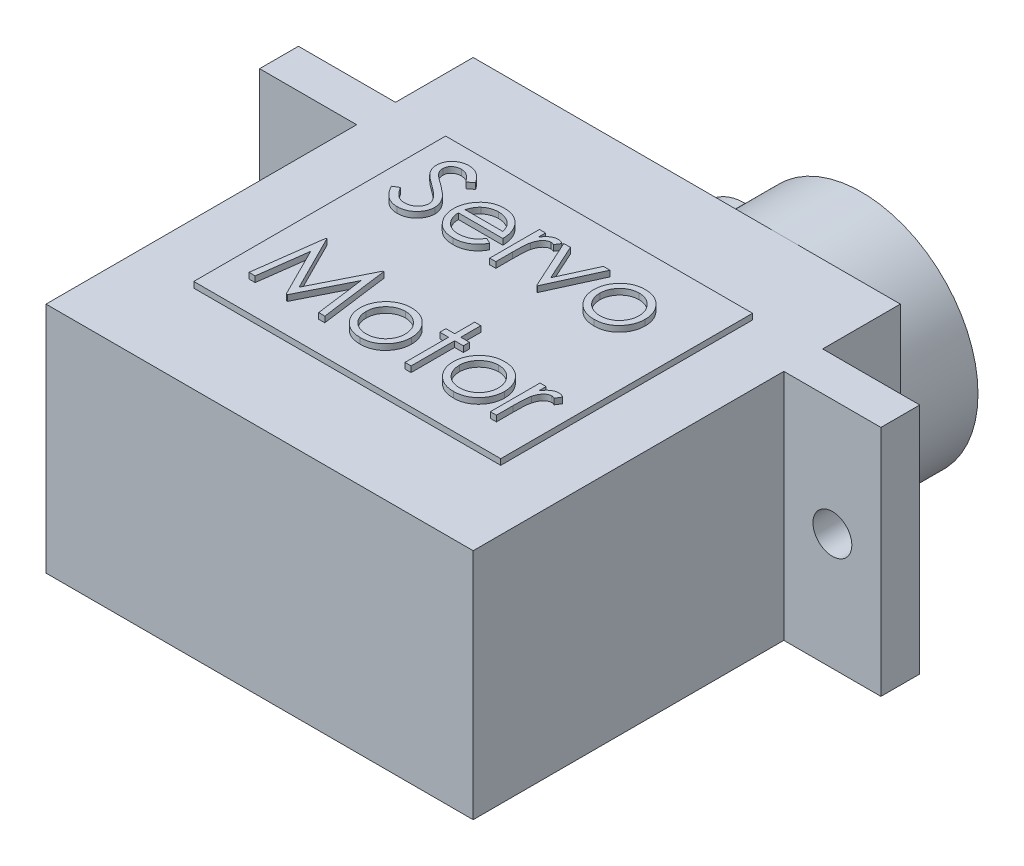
from build123d import *

# Parameters (mm, degrees)
BOSS_EXTRUDE1_DEPTH = 12
BOSS_EXTRUDE2_DEPTH = 4
SKETCH3_W           = 15.808123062
SKETCH3_H           = 12.968405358
BOSS_EXTRUDE3_DEPTH = 0.3
BOSS_EXTRUDE4_DEPTH = 0.3
SKETCH5_R           = 2.5
BOSS_EXTRUDE5_DEPTH = 2
CUT_EXTRUDE2_REACH  = 29.18
SKETCH8_R           = 1


with BuildPart() as part:
    # Sketch1 → Boss-Extrude1 (new body)
    with BuildSketch(Plane(origin=(0, 0, 0), x_dir=(1, 0, 0), z_dir=(0, 1, 0))):
        Polygon((-11, 5), (-11, -11), (11, -11), (11, 5), (16, 5), (16, 7), (11, 7), (11, 11), (-11, 11), (-11, 7), (-16, 7), (-16, 5), align=None)
    extrude(amount=BOSS_EXTRUDE1_DEPTH)

    # Sketch2 → Boss-Extrude2 (add)
    with BuildSketch(Plane(origin=(0, 0, -11), x_dir=(-1, 0, 0), z_dir=(0, 0, -1))):
        with BuildLine():
            Line((1, 8.5), (0.454356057, 8.5))
            ThreePointArc((0.454356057, 8.5), (-11, 6), (0.454356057, 3.5))
            Line((0.454356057, 3.5), (1, 3.5))
            ThreePointArc((1, 3.5), (3.5, 6), (1, 8.5))
        make_face()
    extrude(amount=BOSS_EXTRUDE2_DEPTH)

    # Sketch3 → Boss-Extrude3 (add)
    with BuildSketch(Plane(origin=(0, 12, 0), x_dir=(1, 0, 0), z_dir=(0, 1, 0))):
        Rectangle(SKETCH3_W, SKETCH3_H)
    extrude(amount=BOSS_EXTRUDE3_DEPTH)

    # Sketch4 → Boss-Extrude4 (add)
    # profile 1 of 10: a face of its own
    with BuildSketch(Plane(origin=(0, 12.3, 0), x_dir=(1, 0, 0), z_dir=(0, 1, 0))):
        with BuildLine():
            Line((-6.767422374, 2.553042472), (-6.471548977, 2.730426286))
            add(Edge.make_bspline(
                [(-6.471548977, 2.730426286), (-6.444030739, 2.684361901), (-6.391306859, 2.596104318), (-6.3033555, 2.476846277), (-6.212222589, 2.37548412), (-6.117233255, 2.292607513), (-6.018967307, 2.227358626), (-5.916783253, 2.181156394), (-5.811025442, 2.152340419), (-5.739051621, 2.148840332), (-5.70311949, 2.147092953)],
                knots=[0, 0, 0, 0, 1.272034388, 2.437168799, 3.508375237, 4.49857839, 5.41946034, 6.295179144, 7.148887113, 8, 8, 8, 8], degree=3))
            add(Edge.make_bspline(
                [(-5.70311949, 2.147092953), (-5.672432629, 2.147947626), (-5.611595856, 2.149642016), (-5.522033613, 2.165922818), (-5.435051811, 2.190934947), (-5.352443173, 2.226755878), (-5.275347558, 2.270094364), (-5.207740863, 2.322440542), (-5.14929475, 2.381046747), (-5.101485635, 2.446429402), (-5.0648056, 2.516746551), (-5.036613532, 2.588922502), (-5.020968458, 2.66409107), (-5.018611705, 2.714701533), (-5.017422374, 2.740241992)],
                knots=[0, 0, 0, 0, 1.095163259, 2.171163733, 3.241058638, 4.321873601, 5.38011039, 6.391990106, 7.366004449, 8.327778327, 9.272591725, 10.192022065, 11.087607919, 12, 12, 12, 12], degree=3))
            add(Edge.make_bspline(
                [(-5.017422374, 2.740241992), (-5.018896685, 2.769382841), (-5.021893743, 2.82862193), (-5.047225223, 2.916021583), (-5.08707447, 3.002514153), (-5.123837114, 3.056015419), (-5.142923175, 3.083791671)],
                knots=[0, 0, 0, 0, 0.938893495, 1.908633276, 2.914225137, 4, 4, 4, 4], degree=3))
            add(Edge.make_bspline(
                [(-5.142923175, 3.083791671), (-5.15859379, 3.103838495), (-5.191492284, 3.145924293), (-5.248049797, 3.208569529), (-5.314415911, 3.273187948), (-5.388319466, 3.342247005), (-5.472452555, 3.412534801), (-5.564180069, 3.487403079), (-5.665843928, 3.564004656), (-5.737143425, 3.615377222), (-5.773932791, 3.64188462)],
                knots=[0, 0, 0, 0, 0.722233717, 1.516239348, 2.393582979, 3.351407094, 4.387010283, 5.505090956, 6.712668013, 8, 8, 8, 8], degree=3))
            add(Edge.make_bspline(
                [(-5.773932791, 3.64188462), (-5.810756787, 3.668113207), (-5.881161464, 3.71826027), (-5.979620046, 3.792684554), (-6.067664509, 3.860728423), (-6.144903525, 3.923032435), (-6.211303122, 3.97960504), (-6.267386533, 4.029902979), (-6.31172509, 4.07528654), (-6.336380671, 4.104727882), (-6.347450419, 4.117946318)],
                knots=[0, 0, 0, 0, 1.452282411, 2.77665338, 3.964542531, 5.026858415, 5.96415736, 6.766646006, 7.446254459, 8, 8, 8, 8], degree=3))
            add(Edge.make_bspline(
                [(-6.347450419, 4.117946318), (-6.362922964, 4.138547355), (-6.393351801, 4.179062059), (-6.433517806, 4.242386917), (-6.467656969, 4.307210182), (-6.494419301, 4.373706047), (-6.51695552, 4.440940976), (-6.532113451, 4.509792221), (-6.541604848, 4.57995084), (-6.542576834, 4.62716434), (-6.5430634, 4.650798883)],
                knots=[0, 0, 0, 0, 1.068054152, 2.10047183, 3.106115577, 4.101338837, 5.06977816, 6.043150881, 7.020423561, 8, 8, 8, 8], degree=3))
            add(Edge.make_bspline(
                [(-6.5430634, 4.650798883), (-6.541758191, 4.687828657), (-6.539175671, 4.761096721), (-6.517335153, 4.868127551), (-6.48286226, 4.970313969), (-6.434567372, 5.066644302), (-6.372310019, 5.154610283), (-6.300264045, 5.23522377), (-6.214452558, 5.302992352), (-6.120299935, 5.362204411), (-6.017243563, 5.408550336), (-5.90925266, 5.443511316), (-5.796155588, 5.463320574), (-5.719552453, 5.466163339), (-5.680683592, 5.467605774)],
                knots=[0, 0, 0, 0, 1.005424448, 1.989358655, 2.955360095, 3.929531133, 4.905563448, 5.876582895, 6.856512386, 7.866279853, 8.892233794, 9.918561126, 10.94386622, 12, 12, 12, 12], degree=3))
            add(Edge.make_bspline(
                [(-5.680683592, 5.467605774), (-5.639439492, 5.466183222), (-5.55741814, 5.463354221), (-5.436768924, 5.43875669), (-5.320608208, 5.398056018), (-5.227164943, 5.35186736), (-5.154032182, 5.305735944), (-5.098259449, 5.26371612), (-5.041741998, 5.215341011), (-4.984023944, 5.160481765), (-4.926083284, 5.098635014), (-4.867059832, 5.030224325), (-4.806815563, 4.955667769), (-4.768059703, 4.902443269), (-4.748191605, 4.875157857)],
                knots=[0, 0, 0, 0, 1.286793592, 2.559021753, 3.825965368, 5.121522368, 5.803751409, 6.523245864, 7.299691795, 8.125521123, 9.008227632, 9.944561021, 10.946284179, 12, 12, 12, 12], degree=3))
            Line((-4.748191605, 4.875157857), (-5.032145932, 4.659913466))
            add(Edge.make_bspline(
                [(-5.032145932, 4.659913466), (-5.049291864, 4.682002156), (-5.082310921, 4.72453981), (-5.132440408, 4.784111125), (-5.179689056, 4.838527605), (-5.226239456, 4.885792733), (-5.269633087, 4.928494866), (-5.31175013, 4.965054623), (-5.351984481, 4.995830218), (-5.402701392, 5.028673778), (-5.46641911, 5.061230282), (-5.546403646, 5.08877936), (-5.629989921, 5.105334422), (-5.686919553, 5.107523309), (-5.715739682, 5.108631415)],
                knots=[0, 0, 0, 0, 1.181633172, 2.275549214, 3.290209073, 4.226197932, 5.078386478, 5.862611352, 6.581680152, 7.217281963, 8.414376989, 9.595101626, 10.782541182, 12, 12, 12, 12], degree=3))
            add(Edge.make_bspline(
                [(-5.715739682, 5.108631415), (-5.751896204, 5.107419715), (-5.821620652, 5.105083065), (-5.920610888, 5.07956308), (-6.009704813, 5.03938122), (-6.086257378, 4.983066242), (-6.149994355, 4.916345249), (-6.196099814, 4.839566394), (-6.223849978, 4.754783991), (-6.227236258, 4.695642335), (-6.228960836, 4.66552244)],
                knots=[0, 0, 0, 0, 1.14458467, 2.207223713, 3.21896685, 4.227309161, 5.202851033, 6.127160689, 7.046193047, 8, 8, 8, 8], degree=3))
            add(Edge.make_bspline(
                [(-6.228960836, 4.66552244), (-6.228567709, 4.646770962), (-6.227780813, 4.609237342), (-6.216806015, 4.55378592), (-6.202706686, 4.498474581), (-6.180364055, 4.443551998), (-6.149518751, 4.388057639), (-6.109013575, 4.331035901), (-6.058000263, 4.271984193), (-6.018923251, 4.233576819), (-5.998291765, 4.213298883)],
                knots=[0, 0, 0, 0, 0.858281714, 1.717966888, 2.583508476, 3.4729293, 4.427298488, 5.488583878, 6.674047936, 8, 8, 8, 8], degree=3))
            add(Edge.make_bspline(
                [(-5.998291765, 4.213298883), (-5.990630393, 4.206461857), (-5.972428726, 4.190218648), (-5.9391528, 4.163626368), (-5.895210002, 4.130823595), (-5.8417478, 4.090236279), (-5.777780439, 4.043154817), (-5.703300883, 3.990181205), (-5.61913935, 3.929595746), (-5.559417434, 3.887238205), (-5.527839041, 3.864841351)],
                knots=[0, 0, 0, 0, 0.420754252, 0.999615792, 1.744751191, 2.668019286, 3.750313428, 4.999500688, 6.413464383, 8, 8, 8, 8], degree=3))
            add(Edge.make_bspline(
                [(-5.527839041, 3.864841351), (-5.489853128, 3.837199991), (-5.416298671, 3.783676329), (-5.311641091, 3.703260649), (-5.216747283, 3.624612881), (-5.13128408, 3.548235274), (-5.054407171, 3.474707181), (-4.98696945, 3.403144), (-4.92828377, 3.334058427), (-4.865104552, 3.245485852), (-4.800546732, 3.136704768), (-4.745105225, 3.003426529), (-4.710146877, 2.869630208), (-4.705575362, 2.779703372), (-4.70331981, 2.735334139)],
                knots=[0, 0, 0, 0, 1.163667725, 2.253281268, 3.268753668, 4.215851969, 5.092017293, 5.902905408, 6.650798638, 7.335211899, 8.59617414, 9.77448103, 10.901945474, 12, 12, 12, 12], degree=3))
            add(Edge.make_bspline(
                [(-4.70331981, 2.735334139), (-4.703976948, 2.703955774), (-4.705278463, 2.64180839), (-4.720239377, 2.550553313), (-4.742159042, 2.461922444), (-4.775196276, 2.377011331), (-4.815519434, 2.294266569), (-4.866685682, 2.215858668), (-4.925993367, 2.14005227), (-4.994027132, 2.068868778), (-5.068473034, 2.003522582), (-5.147156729, 1.945393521), (-5.230207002, 1.896925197), (-5.317173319, 1.857374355), (-5.408075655, 1.826440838), (-5.502883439, 1.804027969), (-5.60175295, 1.790272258), (-5.668953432, 1.788844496), (-5.70311949, 1.788118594)],
                knots=[0, 0, 0, 0, 0.983748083, 1.948392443, 2.894712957, 3.844097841, 4.80183111, 5.778335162, 6.776009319, 7.81870978, 8.863265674, 9.881300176, 10.883814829, 11.87499822, 12.874611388, 13.892143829, 14.928324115, 16, 16, 16, 16], degree=3))
            add(Edge.make_bspline(
                [(-5.70311949, 1.788118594), (-5.729554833, 1.788629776), (-5.782092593, 1.789645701), (-5.859802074, 1.798626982), (-5.935941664, 1.811334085), (-6.009555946, 1.831508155), (-6.081593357, 1.855985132), (-6.151740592, 1.886123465), (-6.220031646, 1.922240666), (-6.286849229, 1.963535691), (-6.352023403, 2.011593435), (-6.414942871, 2.067566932), (-6.477672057, 2.129912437), (-6.538359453, 2.200323), (-6.598232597, 2.277661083), (-6.656111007, 2.362650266), (-6.713192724, 2.45482762), (-6.749008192, 2.519692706), (-6.767422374, 2.553042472)],
                knots=[0, 0, 0, 0, 0.915332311, 1.819136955, 2.706846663, 3.586547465, 4.459518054, 5.340707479, 6.227863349, 7.133153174, 8.059268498, 9.028702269, 10.047606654, 11.120612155, 12.245963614, 13.433783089, 14.680604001, 16, 16, 16, 16], degree=3))
        make_face()
    # profile 2 of 10: a face of its own
    with BuildSketch(Plane(origin=(0, 12.3, 0), x_dir=(1, 0, 0), z_dir=(0, 1, 0))):
        with BuildLine():
            Line((-1.975956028, 2.685554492), (-1.696909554, 2.539020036))
            add(Edge.make_bspline(
                [(-1.696909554, 2.539020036), (-1.719146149, 2.499576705), (-1.762409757, 2.422835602), (-1.836810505, 2.317403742), (-1.914802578, 2.222556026), (-1.999906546, 2.140826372), (-2.089576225, 2.069574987), (-2.18430888, 2.007237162), (-2.284597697, 1.954118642), (-2.390447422, 1.909366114), (-2.502746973, 1.87495662), (-2.62176849, 1.850652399), (-2.747739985, 1.83562913), (-2.834086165, 1.833883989), (-2.878299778, 1.832990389)],
                knots=[0, 0, 0, 0, 1.120438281, 2.179929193, 3.190490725, 4.156257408, 5.095198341, 6.022838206, 6.959905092, 7.901321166, 8.864066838, 9.862729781, 10.905609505, 12, 12, 12, 12], degree=3))
            add(Edge.make_bspline(
                [(-2.878299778, 1.832990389), (-2.927441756, 1.834137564), (-3.023303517, 1.836375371), (-3.162843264, 1.855667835), (-3.294222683, 1.887140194), (-3.417434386, 1.931105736), (-3.532176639, 1.98853306), (-3.638677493, 2.058492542), (-3.737497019, 2.140624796), (-3.825521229, 2.23564124), (-3.904765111, 2.337323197), (-3.974690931, 2.443279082), (-4.033148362, 2.553242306), (-4.080700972, 2.66651283), (-4.119105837, 2.782376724), (-4.145872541, 2.901888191), (-4.161302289, 3.024723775), (-4.163666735, 3.107821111), (-4.164858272, 3.14969712)],
                knots=[0, 0, 0, 0, 1.145258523, 2.234067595, 3.276747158, 4.290159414, 5.277019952, 6.260822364, 7.254936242, 8.264827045, 9.274100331, 10.257902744, 11.220704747, 12.172965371, 13.118907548, 14.062713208, 15.023725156, 16, 16, 16, 16], degree=3))
            add(Edge.make_bspline(
                [(-4.164858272, 3.14969712), (-4.16379913, 3.18899195), (-4.161700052, 3.266869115), (-4.148469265, 3.382134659), (-4.125020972, 3.494163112), (-4.092844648, 3.60304756), (-4.051293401, 3.708605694), (-4.000461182, 3.810901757), (-3.940268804, 3.909826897), (-3.893796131, 3.972230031), (-3.870387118, 4.003663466)],
                knots=[0, 0, 0, 0, 1.024358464, 2.0301432, 3.019427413, 4.004406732, 4.986367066, 5.972626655, 6.978780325, 8, 8, 8, 8], degree=3))
            add(Edge.make_bspline(
                [(-3.870387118, 4.003663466), (-3.838679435, 4.041532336), (-3.776268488, 4.116070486), (-3.670712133, 4.214008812), (-3.556411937, 4.296052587), (-3.434800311, 4.364059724), (-3.304463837, 4.415733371), (-3.167154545, 4.454240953), (-3.021308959, 4.475818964), (-2.921603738, 4.478866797), (-2.870587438, 4.480426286)],
                knots=[0, 0, 0, 0, 1.030682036, 2.02871468, 2.997146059, 3.962720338, 4.930598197, 5.918074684, 6.934738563, 8, 8, 8, 8], degree=3))
            add(Edge.make_bspline(
                [(-2.870587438, 4.480426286), (-2.818139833, 4.479072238), (-2.715249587, 4.476415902), (-2.565217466, 4.451789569), (-2.423256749, 4.412737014), (-2.289424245, 4.357583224), (-2.163706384, 4.286423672), (-2.046920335, 4.198281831), (-1.937068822, 4.095863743), (-1.873160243, 4.017100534), (-1.840639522, 3.977020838)],
                knots=[0, 0, 0, 0, 1.056321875, 2.072262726, 3.055038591, 4.01806755, 4.982017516, 5.957941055, 6.960871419, 8, 8, 8, 8], degree=3))
            add(Edge.make_bspline(
                [(-1.840639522, 3.977020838), (-1.818512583, 3.946817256), (-1.77440599, 3.886611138), (-1.71915889, 3.788439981), (-1.671201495, 3.685729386), (-1.632868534, 3.576819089), (-1.601829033, 3.462999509), (-1.579372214, 3.343456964), (-1.566202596, 3.218227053), (-1.563613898, 3.132900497), (-1.562294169, 3.089400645)],
                knots=[0, 0, 0, 0, 0.94817472, 1.890038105, 2.849395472, 3.817997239, 4.812318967, 5.836947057, 6.897266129, 8, 8, 8, 8], degree=3))
            Line((-1.562294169, 3.089400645), (-3.850755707, 3.089400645))
            add(Edge.make_bspline(
                [(-3.850755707, 3.089400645), (-3.849216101, 3.055700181), (-3.846188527, 2.989429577), (-3.832073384, 2.892458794), (-3.80982461, 2.800085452), (-3.778555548, 2.71300241), (-3.740688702, 2.630072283), (-3.694302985, 2.551910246), (-3.638963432, 2.478872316), (-3.577237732, 2.410305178), (-3.508530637, 2.349244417), (-3.43624789, 2.294592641), (-3.359354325, 2.248787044), (-3.278456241, 2.211607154), (-3.193684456, 2.182500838), (-3.105012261, 2.162633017), (-3.012614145, 2.149325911), (-2.94962841, 2.147846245), (-2.917562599, 2.147092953)],
                knots=[0, 0, 0, 0, 1.094153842, 2.151609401, 3.174256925, 4.172055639, 5.149267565, 6.128595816, 7.11444997, 8.118368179, 9.117203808, 10.09244225, 11.054858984, 12.015122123, 12.976791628, 13.957293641, 14.960065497, 16, 16, 16, 16], degree=3))
            add(Edge.make_bspline(
                [(-2.917562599, 2.147092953), (-2.886211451, 2.14770101), (-2.82400476, 2.148907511), (-2.731363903, 2.160639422), (-2.640224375, 2.179609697), (-2.550963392, 2.205499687), (-2.465392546, 2.23707654), (-2.386146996, 2.275179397), (-2.31326678, 2.317329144), (-2.245149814, 2.365538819), (-2.17907882, 2.424547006), (-2.113536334, 2.498182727), (-2.043259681, 2.585270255), (-1.999270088, 2.650815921), (-1.975956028, 2.685554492)],
                knots=[0, 0, 0, 0, 0.99110716, 1.966546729, 2.947904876, 3.932708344, 4.903319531, 5.828989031, 6.710028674, 7.56322171, 8.463672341, 9.504779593, 10.677557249, 12, 12, 12, 12], degree=3))
        make_face()
        with BuildLine():
            add(Edge.make_bspline(
                [(-1.876396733, 3.403503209), (-1.887893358, 3.445166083), (-1.910020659, 3.525353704), (-1.956257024, 3.636394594), (-2.008328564, 3.735082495), (-2.069950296, 3.820662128), (-2.139769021, 3.896665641), (-2.220414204, 3.963084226), (-2.310850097, 4.022501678), (-2.410609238, 4.072654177), (-2.516251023, 4.115344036), (-2.626857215, 4.143969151), (-2.739715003, 4.163578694), (-2.816049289, 4.165404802), (-2.854461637, 4.166323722)],
                knots=[0, 0, 0, 0, 1.154881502, 2.222775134, 3.210006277, 4.132804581, 5.035138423, 5.962687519, 6.919655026, 7.923214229, 8.944639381, 9.960483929, 10.97369054, 12, 12, 12, 12], degree=3))
            add(Edge.make_bspline(
                [(-2.854461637, 4.166323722), (-2.885811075, 4.165712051), (-2.947782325, 4.164502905), (-3.039083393, 4.153032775), (-3.126763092, 4.134072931), (-3.211468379, 4.108107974), (-3.292089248, 4.073499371), (-3.370284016, 4.032916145), (-3.444064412, 3.983374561), (-3.490205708, 3.945615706), (-3.513516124, 3.926540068)],
                knots=[0, 0, 0, 0, 1.04873581, 2.073130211, 3.073294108, 4.04793562, 5.032784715, 6.005352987, 6.992311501, 8, 8, 8, 8], degree=3))
            add(Edge.make_bspline(
                [(-3.513516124, 3.926540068), (-3.530209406, 3.911445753), (-3.56399254, 3.880898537), (-3.609133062, 3.82826933), (-3.652353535, 3.771517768), (-3.691687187, 3.708472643), (-3.727764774, 3.639851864), (-3.761524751, 3.566234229), (-3.791911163, 3.487061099), (-3.809007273, 3.43188866), (-3.817802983, 3.403503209)],
                knots=[0, 0, 0, 0, 0.879870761, 1.780643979, 2.707998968, 3.669668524, 4.684282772, 5.740141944, 6.837334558, 8, 8, 8, 8], degree=3))
            Line((-3.817802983, 3.403503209), (-1.876396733, 3.403503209))
        make_face(mode=Mode.SUBTRACT)
    # profile 3 of 10: a face of its own
    with BuildSketch(Plane(origin=(0, 12.3, 0), x_dir=(1, 0, 0), z_dir=(0, 1, 0))):
        with BuildLine():
            Line((-1.023832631, 4.435554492), (-0.709730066, 4.435554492))
            Line((-0.709730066, 4.435554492), (-0.709730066, 4.059052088))
            add(Edge.make_bspline(
                [(-0.709730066, 4.059052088), (-0.686541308, 4.094107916), (-0.642192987, 4.161151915), (-0.568480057, 4.249821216), (-0.492976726, 4.323236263), (-0.415321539, 4.381739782), (-0.334943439, 4.425552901), (-0.253606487, 4.457645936), (-0.170031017, 4.476623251), (-0.113869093, 4.47915691), (-0.085731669, 4.480426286)],
                knots=[0, 0, 0, 0, 1.2804753, 2.448899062, 3.506932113, 4.484331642, 5.4025378, 6.288909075, 7.142734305, 8, 8, 8, 8], degree=3))
            add(Edge.make_bspline(
                [(-0.085731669, 4.480426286), (-0.063905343, 4.47923576), (-0.018996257, 4.476786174), (0.048986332, 4.459575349), (0.119029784, 4.432097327), (0.164172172, 4.406257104), (0.187705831, 4.392786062)],
                knots=[0, 0, 0, 0, 0.901110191, 1.854092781, 2.881294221, 4, 4, 4, 4], degree=3))
            Line((0.187705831, 4.392786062), (0.015229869, 4.120750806))
            add(Edge.make_bspline(
                [(0.015229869, 4.120750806), (0.000120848, 4.127491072), (-0.028558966, 4.140285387), (-0.070513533, 4.155427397), (-0.109194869, 4.164343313), (-0.133838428, 4.165694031), (-0.145327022, 4.166323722)],
                knots=[0, 0, 0, 0, 1.180555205, 2.24091978, 3.179933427, 4, 4, 4, 4], degree=3))
            add(Edge.make_bspline(
                [(-0.145327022, 4.166323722), (-0.170532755, 4.164643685), (-0.221945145, 4.161216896), (-0.297429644, 4.134278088), (-0.37067685, 4.090752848), (-0.428848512, 4.042481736), (-0.473890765, 3.995933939), (-0.506030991, 3.955285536), (-0.535513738, 3.909706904), (-0.563683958, 3.859977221), (-0.589350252, 3.805247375), (-0.613304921, 3.746064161), (-0.634963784, 3.682359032), (-0.647314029, 3.637976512), (-0.653640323, 3.615241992)],
                knots=[0, 0, 0, 0, 1.125678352, 2.296057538, 3.5422874, 4.923748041, 5.663163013, 6.437101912, 7.23742474, 8.08941207, 8.991984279, 9.93940061, 10.944477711, 12, 12, 12, 12], degree=3))
            add(Edge.make_bspline(
                [(-0.653640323, 3.615241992), (-0.658372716, 3.594964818), (-0.668854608, 3.550052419), (-0.679046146, 3.474703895), (-0.689115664, 3.385680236), (-0.696212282, 3.282733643), (-0.702790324, 3.166121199), (-0.706500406, 3.035665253), (-0.709603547, 2.891231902), (-0.709686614, 2.790257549), (-0.709730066, 2.737437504)],
                knots=[0, 0, 0, 0, 0.566838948, 1.255505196, 2.06880316, 3.007127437, 4.065329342, 5.249902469, 6.561414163, 8, 8, 8, 8], degree=3))
            Line((-0.709730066, 2.737437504), (-0.709730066, 1.877862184))
            Line((-0.709730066, 1.877862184), (-1.023832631, 1.877862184))
            Line((-1.023832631, 1.877862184), (-1.023832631, 4.435554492))
        make_face()
    # profile 4 of 10: a face of its own
    with BuildSketch(Plane(origin=(0, 12.3, 0), x_dir=(1, 0, 0), z_dir=(0, 1, 0))):
        Polygon((0.232577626, 4.435554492), (0.572621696, 4.435554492), (1.42168019, 2.573375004), (2.270738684, 4.435554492), (2.610782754, 4.435554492), (1.444116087, 1.877862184), (1.399244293, 1.877862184), align=None)
    # profile 5 of 10: a face of its own
    with BuildSketch(Plane(origin=(0, 12.3, 0), x_dir=(1, 0, 0), z_dir=(0, 1, 0))):
        with BuildLine():
            add(Edge.make_bspline(
                [(4.384620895, 4.480426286), (4.432612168, 4.479404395), (4.526711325, 4.477400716), (4.664519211, 4.455985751), (4.796064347, 4.423238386), (4.921850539, 4.377966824), (5.040266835, 4.317284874), (5.153038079, 4.244875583), (5.259855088, 4.159092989), (5.323878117, 4.092734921), (5.356375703, 4.059052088)],
                knots=[0, 0, 0, 0, 1.054011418, 2.066658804, 3.057071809, 4.030435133, 4.997543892, 5.974964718, 6.972108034, 8, 8, 8, 8], degree=3))
            add(Edge.make_bspline(
                [(5.356375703, 4.059052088), (5.384357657, 4.026838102), (5.439780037, 3.96303356), (5.510845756, 3.859577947), (5.572067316, 3.752437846), (5.621130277, 3.640190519), (5.659815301, 3.523815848), (5.687280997, 3.402913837), (5.703617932, 3.27775149), (5.705820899, 3.192747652), (5.7069366, 3.14969712)],
                knots=[0, 0, 0, 0, 1.025258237, 2.030674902, 3.01204498, 3.988269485, 4.97094183, 5.956517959, 6.965070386, 8, 8, 8, 8], degree=3))
            add(Edge.make_bspline(
                [(5.7069366, 3.14969712), (5.705955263, 3.106397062), (5.704016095, 3.020834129), (5.685672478, 2.894814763), (5.657141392, 2.77261994), (5.616309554, 2.654761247), (5.563951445, 2.540878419), (5.500060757, 2.43146887), (5.42418914, 2.326316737), (5.338185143, 2.226314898), (5.243133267, 2.134148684), (5.140017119, 2.053820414), (5.030863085, 1.98499889), (4.914219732, 1.929562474), (4.791152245, 1.885852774), (4.661395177, 1.855152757), (4.525150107, 1.836591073), (4.432122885, 1.8342075), (4.384620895, 1.832990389)],
                knots=[0, 0, 0, 0, 0.998656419, 1.973391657, 2.932242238, 3.890759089, 4.846373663, 5.82037756, 6.809684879, 7.83454468, 8.860553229, 9.859544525, 10.845671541, 11.83227036, 12.833544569, 13.85385346, 14.904124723, 16, 16, 16, 16], degree=3))
            add(Edge.make_bspline(
                [(4.384620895, 1.832990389), (4.336886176, 1.834211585), (4.243395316, 1.83660336), (4.106669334, 1.855080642), (3.976679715, 1.885838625), (3.853451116, 1.929706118), (3.73630627, 1.985000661), (3.626519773, 2.053612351), (3.523319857, 2.134172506), (3.428247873, 2.226308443), (3.342249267, 2.3263184), (3.266376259, 2.431468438), (3.202485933, 2.540878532), (3.150127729, 2.654761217), (3.109295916, 2.772619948), (3.080764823, 2.894814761), (3.062421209, 3.020834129), (3.06048204, 3.106397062), (3.059500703, 3.14969712)],
                knots=[0, 0, 0, 0, 1.099876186, 2.154163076, 3.173186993, 4.173200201, 5.163417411, 6.152872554, 7.150605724, 8.17532212, 9.198891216, 10.186952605, 11.159729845, 12.11414092, 13.071450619, 14.029093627, 15.002601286, 16, 16, 16, 16], degree=3))
            add(Edge.make_bspline(
                [(3.059500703, 3.14969712), (3.060624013, 3.192513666), (3.062847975, 3.277283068), (3.079168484, 3.402210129), (3.10652704, 3.522907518), (3.145258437, 3.638832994), (3.194773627, 3.75058843), (3.255134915, 3.857993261), (3.326925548, 3.960981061), (3.382127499, 4.024703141), (3.4100616, 4.056948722)],
                knots=[0, 0, 0, 0, 1.031353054, 2.041901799, 3.029428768, 4.008703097, 4.981709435, 5.96992636, 6.972712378, 8, 8, 8, 8], degree=3))
            add(Edge.make_bspline(
                [(3.4100616, 4.056948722), (3.442510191, 4.090923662), (3.506326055, 4.157741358), (3.613674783, 4.243273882), (3.726168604, 4.317189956), (3.84589353, 4.376666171), (3.971576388, 4.423504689), (4.103795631, 4.456070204), (4.242071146, 4.477323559), (4.336630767, 4.479381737), (4.384620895, 4.480426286)],
                knots=[0, 0, 0, 0, 1.027980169, 2.021703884, 2.998553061, 3.971491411, 4.943284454, 5.930300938, 6.949603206, 8, 8, 8, 8], degree=3))
        make_face()
        with BuildLine():
            add(Edge.make_bspline(
                [(4.383218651, 4.166323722), (4.34928104, 4.165359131), (4.282281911, 4.163454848), (4.183662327, 4.148970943), (4.088722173, 4.126023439), (3.997281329, 4.093419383), (3.909648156, 4.051320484), (3.825738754, 3.999612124), (3.745306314, 3.938979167), (3.669924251, 3.869516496), (3.600741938, 3.793637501), (3.540263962, 3.712789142), (3.488838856, 3.628282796), (3.445998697, 3.540030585), (3.414091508, 3.447138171), (3.390918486, 3.35065754), (3.376448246, 3.250392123), (3.374561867, 3.182231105), (3.373603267, 3.147593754)],
                knots=[0, 0, 0, 0, 1.021534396, 2.016698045, 2.994645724, 3.958388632, 4.93408049, 5.916473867, 6.921342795, 7.962252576, 8.998418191, 10.008913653, 10.997312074, 11.973003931, 12.956656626, 13.948281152, 14.957379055, 16, 16, 16, 16], degree=3))
            add(Edge.make_bspline(
                [(3.373603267, 3.147593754), (3.375210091, 3.102841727), (3.378399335, 3.014017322), (3.404334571, 2.883206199), (3.447720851, 2.757624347), (3.506308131, 2.638007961), (3.57971435, 2.527335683), (3.666201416, 2.428664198), (3.764841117, 2.343478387), (3.874457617, 2.272797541), (3.992811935, 2.216637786), (4.118068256, 2.17683881), (4.24870895, 2.150967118), (4.337989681, 2.148395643), (4.383218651, 2.147092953)],
                knots=[0, 0, 0, 0, 1.016792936, 2.018143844, 3.017858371, 4.030088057, 5.03801393, 6.028138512, 7.003788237, 7.991172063, 8.984598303, 9.972568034, 10.972917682, 12, 12, 12, 12], degree=3))
            add(Edge.make_bspline(
                [(4.383218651, 2.147092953), (4.42844502, 2.148403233), (4.517720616, 2.15098969), (4.648179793, 2.17670851), (4.773093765, 2.216812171), (4.891325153, 2.272734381), (5.000891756, 2.343746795), (5.100240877, 2.428183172), (5.185989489, 2.527597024), (5.259323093, 2.638154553), (5.318869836, 2.757438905), (5.362053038, 2.883229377), (5.388050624, 3.014011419), (5.391231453, 3.10283975), (5.392834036, 3.147593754)],
                knots=[0, 0, 0, 0, 1.02726834, 2.027799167, 3.010890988, 4.004497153, 4.992059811, 5.971914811, 6.958719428, 7.966827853, 8.981595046, 9.981490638, 10.983022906, 12, 12, 12, 12], degree=3))
            add(Edge.make_bspline(
                [(5.392834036, 3.147593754), (5.391875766, 3.182231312), (5.389990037, 3.250392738), (5.375515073, 3.350655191), (5.352359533, 3.447146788), (5.320387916, 3.539998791), (5.277733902, 3.628511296), (5.225317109, 3.712541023), (5.165086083, 3.793917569), (5.095068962, 3.869271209), (5.019765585, 3.939006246), (4.939300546, 3.999635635), (4.855515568, 4.051093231), (4.768136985, 4.093779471), (4.676684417, 4.125726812), (4.581877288, 4.149103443), (4.483678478, 4.16339364), (4.416919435, 4.165340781), (4.383218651, 4.166323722)],
                knots=[0, 0, 0, 0, 1.042956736, 2.052379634, 3.044323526, 4.02829302, 5.004299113, 5.996692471, 7.007513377, 8.048758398, 9.090003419, 10.095195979, 11.07790575, 12.047570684, 13.018257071, 13.989683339, 14.985167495, 16, 16, 16, 16], degree=3))
        make_face(mode=Mode.SUBTRACT)
    # profile 6 of 10: a face of its own
    with BuildSketch(Plane(origin=(0, 12.3, 0), x_dir=(1, 0, 0), z_dir=(0, 1, 0))):
        Polygon((-6.587935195, -4.955471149), (-6.125895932, -1.455471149), (-6.081024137, -1.455471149), (-4.636012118, -4.327266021), (-3.194505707, -1.455471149), (-3.148932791, -1.455471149), (-2.684089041, -4.955471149), (-2.999593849, -4.955471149), (-3.334730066, -2.437041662), (-4.598151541, -4.955471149), (-4.668964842, -4.955471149), (-5.937294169, -2.431432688), (-6.271729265, -4.955471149), align=None)
    # profile 7 of 10: a face of its own
    with BuildSketch(Plane(origin=(0, 12.3, 0), x_dir=(1, 0, 0), z_dir=(0, 1, 0))):
        with BuildLine():
            add(Edge.make_bspline(
                [(-0.82050731, -2.352907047), (-0.772516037, -2.353928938), (-0.67841688, -2.355932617), (-0.540608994, -2.377347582), (-0.409063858, -2.410094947), (-0.283277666, -2.455366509), (-0.16486137, -2.51604846), (-0.052090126, -2.588457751), (0.054726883, -2.674240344), (0.118749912, -2.740598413), (0.151247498, -2.774281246)],
                knots=[0, 0, 0, 0, 1.054011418, 2.066658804, 3.057071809, 4.030435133, 4.997543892, 5.974964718, 6.972108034, 8, 8, 8, 8], degree=3))
            add(Edge.make_bspline(
                [(0.151247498, -2.774281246), (0.179229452, -2.806495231), (0.234651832, -2.870299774), (0.305717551, -2.973755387), (0.366939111, -3.080895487), (0.416002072, -3.193142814), (0.454687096, -3.309517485), (0.482152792, -3.430419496), (0.498489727, -3.555581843), (0.500692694, -3.640585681), (0.501808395, -3.683636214)],
                knots=[0, 0, 0, 0, 1.025258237, 2.030674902, 3.01204498, 3.988269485, 4.97094183, 5.956517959, 6.965070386, 8, 8, 8, 8], degree=3))
            add(Edge.make_bspline(
                [(0.501808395, -3.683636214), (0.500827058, -3.726936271), (0.498887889, -3.812499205), (0.480544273, -3.93851857), (0.452013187, -4.060713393), (0.411181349, -4.178572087), (0.35882324, -4.292454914), (0.294932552, -4.401864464), (0.219060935, -4.507016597), (0.133056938, -4.607018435), (0.038005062, -4.69918465), (-0.065111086, -4.779512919), (-0.17426512, -4.848334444), (-0.290908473, -4.903770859), (-0.41397596, -4.94748056), (-0.543733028, -4.978180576), (-0.679978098, -4.99674226), (-0.77300532, -4.999125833), (-0.82050731, -5.000342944)],
                knots=[0, 0, 0, 0, 0.998656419, 1.973391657, 2.932242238, 3.890759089, 4.846373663, 5.82037756, 6.809684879, 7.83454468, 8.860553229, 9.859544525, 10.845671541, 11.83227036, 12.833544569, 13.85385346, 14.904124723, 16, 16, 16, 16], degree=3))
            add(Edge.make_bspline(
                [(-0.82050731, -5.000342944), (-0.86824203, -4.999121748), (-0.961732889, -4.996729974), (-1.098458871, -4.978252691), (-1.22844849, -4.947494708), (-1.351677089, -4.903627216), (-1.468821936, -4.848332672), (-1.578608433, -4.779720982), (-1.681808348, -4.699160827), (-1.776880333, -4.60702489), (-1.862878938, -4.507014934), (-1.938751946, -4.401864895), (-2.002642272, -4.292454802), (-2.055000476, -4.178572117), (-2.095832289, -4.060713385), (-2.124363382, -3.938518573), (-2.142706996, -3.812499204), (-2.144646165, -3.726936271), (-2.145627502, -3.683636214)],
                knots=[0, 0, 0, 0, 1.099876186, 2.154163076, 3.173186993, 4.173200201, 5.163417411, 6.152872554, 7.150605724, 8.17532212, 9.198891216, 10.186952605, 11.159729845, 12.11414092, 13.071450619, 14.029093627, 15.002601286, 16, 16, 16, 16], degree=3))
            add(Edge.make_bspline(
                [(-2.145627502, -3.683636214), (-2.144504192, -3.640819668), (-2.142280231, -3.556050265), (-2.125959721, -3.431123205), (-2.098601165, -3.310425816), (-2.059869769, -3.19450034), (-2.010354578, -3.082744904), (-1.94999329, -2.975340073), (-1.878202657, -2.872352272), (-1.823000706, -2.808630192), (-1.795066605, -2.776384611)],
                knots=[0, 0, 0, 0, 1.031353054, 2.041901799, 3.029428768, 4.008703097, 4.981709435, 5.96992636, 6.972712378, 8, 8, 8, 8], degree=3))
            add(Edge.make_bspline(
                [(-1.795066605, -2.776384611), (-1.762618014, -2.742409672), (-1.69880215, -2.675591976), (-1.591453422, -2.590059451), (-1.478959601, -2.516143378), (-1.359234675, -2.456667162), (-1.233551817, -2.409828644), (-1.101332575, -2.377263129), (-0.963057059, -2.356009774), (-0.868497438, -2.353951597), (-0.82050731, -2.352907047)],
                knots=[0, 0, 0, 0, 1.027980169, 2.021703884, 2.998553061, 3.971491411, 4.943284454, 5.930300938, 6.949603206, 8, 8, 8, 8], degree=3))
        make_face()
        with BuildLine():
            add(Edge.make_bspline(
                [(-0.821909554, -2.667009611), (-0.855847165, -2.667974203), (-0.922846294, -2.669878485), (-1.021465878, -2.68436239), (-1.116406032, -2.707309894), (-1.207846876, -2.73991395), (-1.295480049, -2.782012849), (-1.379389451, -2.833721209), (-1.459821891, -2.894354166), (-1.535203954, -2.963816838), (-1.604386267, -3.039695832), (-1.664864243, -3.120544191), (-1.71628935, -3.205050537), (-1.759129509, -3.293302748), (-1.791036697, -3.386195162), (-1.814209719, -3.482675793), (-1.82867996, -3.58294121), (-1.830566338, -3.651102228), (-1.831524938, -3.685739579)],
                knots=[0, 0, 0, 0, 1.021534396, 2.016698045, 2.994645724, 3.958388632, 4.93408049, 5.916473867, 6.921342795, 7.962252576, 8.998418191, 10.008913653, 10.997312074, 11.973003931, 12.956656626, 13.948281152, 14.957379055, 16, 16, 16, 16], degree=3))
            add(Edge.make_bspline(
                [(-1.831524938, -3.685739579), (-1.829918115, -3.730491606), (-1.82672887, -3.819316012), (-1.800793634, -3.950127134), (-1.757407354, -4.075708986), (-1.698820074, -4.195325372), (-1.625413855, -4.30599765), (-1.538926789, -4.404669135), (-1.440287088, -4.489854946), (-1.330670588, -4.560535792), (-1.21231627, -4.616695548), (-1.087059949, -4.656494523), (-0.956419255, -4.682366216), (-0.867138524, -4.68493769), (-0.821909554, -4.68624038)],
                knots=[0, 0, 0, 0, 1.016792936, 2.018143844, 3.017858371, 4.030088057, 5.03801393, 6.028138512, 7.003788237, 7.991172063, 8.984598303, 9.972568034, 10.972917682, 12, 12, 12, 12], degree=3))
            add(Edge.make_bspline(
                [(-0.821909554, -4.68624038), (-0.776683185, -4.6849301), (-0.687407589, -4.682343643), (-0.556948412, -4.656624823), (-0.43203444, -4.616521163), (-0.313803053, -4.560598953), (-0.204236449, -4.489586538), (-0.104887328, -4.405150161), (-0.019138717, -4.30573631), (0.054194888, -4.195178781), (0.113741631, -4.075894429), (0.156924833, -3.950103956), (0.182922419, -3.819321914), (0.186103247, -3.730493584), (0.187705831, -3.685739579)],
                knots=[0, 0, 0, 0, 1.02726834, 2.027799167, 3.010890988, 4.004497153, 4.992059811, 5.971914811, 6.958719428, 7.966827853, 8.981595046, 9.981490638, 10.983022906, 12, 12, 12, 12], degree=3))
            add(Edge.make_bspline(
                [(0.187705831, -3.685739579), (0.186747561, -3.651102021), (0.184861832, -3.582940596), (0.170386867, -3.482678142), (0.147231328, -3.386186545), (0.115259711, -3.293334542), (0.072605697, -3.204822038), (0.020188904, -3.120792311), (-0.040042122, -3.039415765), (-0.110059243, -2.964062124), (-0.185362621, -2.894327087), (-0.265827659, -2.833697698), (-0.349612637, -2.782240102), (-0.43699122, -2.739553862), (-0.528443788, -2.707606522), (-0.623250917, -2.68422989), (-0.721449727, -2.669939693), (-0.78820877, -2.667992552), (-0.821909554, -2.667009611)],
                knots=[0, 0, 0, 0, 1.042956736, 2.052379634, 3.044323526, 4.02829302, 5.004299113, 5.996692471, 7.007513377, 8.048758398, 9.090003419, 10.095195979, 11.07790575, 12.047570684, 13.018257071, 13.989683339, 14.985167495, 16, 16, 16, 16], degree=3))
        make_face(mode=Mode.SUBTRACT)
    # profile 8 of 10: a face of its own
    with BuildSketch(Plane(origin=(0, 12.3, 0), x_dir=(1, 0, 0), z_dir=(0, 1, 0))):
        Polygon((1.444116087, -1.36572756), (1.758218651, -1.36572756), (1.758218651, -2.397778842), (2.2069366, -2.397778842), (2.2069366, -2.711881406), (1.758218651, -2.711881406), (1.758218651, -4.955471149), (1.444116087, -4.955471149), (1.444116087, -2.711881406), (0.995398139, -2.711881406), (0.995398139, -2.397778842), (1.444116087, -2.397778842), align=None)
    # profile 9 of 10: a face of its own
    with BuildSketch(Plane(origin=(0, 12.3, 0), x_dir=(1, 0, 0), z_dir=(0, 1, 0))):
        with BuildLine():
            add(Edge.make_bspline(
                [(3.980774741, -2.352907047), (4.028766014, -2.353928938), (4.122865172, -2.355932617), (4.260673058, -2.377347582), (4.392218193, -2.410094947), (4.518004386, -2.455366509), (4.636420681, -2.51604846), (4.749191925, -2.588457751), (4.856008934, -2.674240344), (4.920031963, -2.740598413), (4.952529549, -2.774281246)],
                knots=[0, 0, 0, 0, 1.054011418, 2.066658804, 3.057071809, 4.030435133, 4.997543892, 5.974964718, 6.972108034, 8, 8, 8, 8], degree=3))
            add(Edge.make_bspline(
                [(4.952529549, -2.774281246), (4.980511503, -2.806495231), (5.035933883, -2.870299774), (5.106999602, -2.973755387), (5.168221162, -3.080895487), (5.217284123, -3.193142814), (5.255969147, -3.309517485), (5.283434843, -3.430419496), (5.299771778, -3.555581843), (5.301974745, -3.640585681), (5.303090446, -3.683636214)],
                knots=[0, 0, 0, 0, 1.025258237, 2.030674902, 3.01204498, 3.988269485, 4.97094183, 5.956517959, 6.965070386, 8, 8, 8, 8], degree=3))
            add(Edge.make_bspline(
                [(5.303090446, -3.683636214), (5.302109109, -3.726936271), (5.300169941, -3.812499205), (5.281826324, -3.93851857), (5.253295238, -4.060713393), (5.2124634, -4.178572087), (5.160105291, -4.292454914), (5.096214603, -4.401864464), (5.020342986, -4.507016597), (4.93433899, -4.607018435), (4.839287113, -4.69918465), (4.736170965, -4.779512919), (4.627016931, -4.848334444), (4.510373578, -4.903770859), (4.387306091, -4.94748056), (4.257549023, -4.978180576), (4.121303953, -4.99674226), (4.028276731, -4.999125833), (3.980774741, -5.000342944)],
                knots=[0, 0, 0, 0, 0.998656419, 1.973391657, 2.932242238, 3.890759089, 4.846373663, 5.82037756, 6.809684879, 7.83454468, 8.860553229, 9.859544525, 10.845671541, 11.83227036, 12.833544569, 13.85385346, 14.904124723, 16, 16, 16, 16], degree=3))
            add(Edge.make_bspline(
                [(3.980774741, -5.000342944), (3.933040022, -4.999121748), (3.839549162, -4.996729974), (3.70282318, -4.978252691), (3.572833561, -4.947494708), (3.449604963, -4.903627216), (3.332460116, -4.848332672), (3.222673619, -4.779720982), (3.119473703, -4.699160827), (3.024401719, -4.60702489), (2.938403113, -4.507014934), (2.862530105, -4.401864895), (2.798639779, -4.292454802), (2.746281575, -4.178572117), (2.705449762, -4.060713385), (2.676918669, -3.938518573), (2.658575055, -3.812499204), (2.656635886, -3.726936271), (2.655654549, -3.683636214)],
                knots=[0, 0, 0, 0, 1.099876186, 2.154163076, 3.173186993, 4.173200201, 5.163417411, 6.152872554, 7.150605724, 8.17532212, 9.198891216, 10.186952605, 11.159729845, 12.11414092, 13.071450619, 14.029093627, 15.002601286, 16, 16, 16, 16], degree=3))
            add(Edge.make_bspline(
                [(2.655654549, -3.683636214), (2.656777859, -3.640819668), (2.659001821, -3.556050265), (2.67532233, -3.431123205), (2.702680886, -3.310425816), (2.741412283, -3.19450034), (2.790927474, -3.082744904), (2.851288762, -2.975340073), (2.923079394, -2.872352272), (2.978281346, -2.808630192), (3.006215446, -2.776384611)],
                knots=[0, 0, 0, 0, 1.031353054, 2.041901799, 3.029428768, 4.008703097, 4.981709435, 5.96992636, 6.972712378, 8, 8, 8, 8], degree=3))
            add(Edge.make_bspline(
                [(3.006215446, -2.776384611), (3.038664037, -2.742409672), (3.102479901, -2.675591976), (3.209828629, -2.590059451), (3.32232245, -2.516143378), (3.442047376, -2.456667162), (3.567730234, -2.409828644), (3.699949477, -2.377263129), (3.838224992, -2.356009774), (3.932784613, -2.353951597), (3.980774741, -2.352907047)],
                knots=[0, 0, 0, 0, 1.027980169, 2.021703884, 2.998553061, 3.971491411, 4.943284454, 5.930300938, 6.949603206, 8, 8, 8, 8], degree=3))
        make_face()
        with BuildLine():
            add(Edge.make_bspline(
                [(3.979372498, -2.667009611), (3.945434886, -2.667974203), (3.878435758, -2.669878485), (3.779816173, -2.68436239), (3.684876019, -2.707309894), (3.593435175, -2.73991395), (3.505802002, -2.782012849), (3.4218926, -2.833721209), (3.34146016, -2.894354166), (3.266078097, -2.963816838), (3.196895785, -3.039695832), (3.136417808, -3.120544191), (3.084992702, -3.205050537), (3.042152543, -3.293302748), (3.010245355, -3.386195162), (2.987072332, -3.482675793), (2.972602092, -3.58294121), (2.970715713, -3.651102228), (2.969757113, -3.685739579)],
                knots=[0, 0, 0, 0, 1.021534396, 2.016698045, 2.994645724, 3.958388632, 4.93408049, 5.916473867, 6.921342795, 7.962252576, 8.998418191, 10.008913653, 10.997312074, 11.973003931, 12.956656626, 13.948281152, 14.957379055, 16, 16, 16, 16], degree=3))
            add(Edge.make_bspline(
                [(2.969757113, -3.685739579), (2.971363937, -3.730491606), (2.974553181, -3.819316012), (3.000488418, -3.950127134), (3.043874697, -4.075708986), (3.102461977, -4.195325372), (3.175868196, -4.30599765), (3.262355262, -4.404669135), (3.360994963, -4.489854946), (3.470611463, -4.560535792), (3.588965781, -4.616695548), (3.714222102, -4.656494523), (3.844862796, -4.682366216), (3.934143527, -4.68493769), (3.979372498, -4.68624038)],
                knots=[0, 0, 0, 0, 1.016792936, 2.018143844, 3.017858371, 4.030088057, 5.03801393, 6.028138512, 7.003788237, 7.991172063, 8.984598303, 9.972568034, 10.972917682, 12, 12, 12, 12], degree=3))
            add(Edge.make_bspline(
                [(3.979372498, -4.68624038), (4.024598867, -4.6849301), (4.113874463, -4.682343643), (4.244333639, -4.656624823), (4.369247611, -4.616521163), (4.487478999, -4.560598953), (4.597045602, -4.489586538), (4.696394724, -4.405150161), (4.782143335, -4.30573631), (4.85547694, -4.195178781), (4.915023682, -4.075894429), (4.958206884, -3.950103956), (4.98420447, -3.819321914), (4.987385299, -3.730493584), (4.988987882, -3.685739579)],
                knots=[0, 0, 0, 0, 1.02726834, 2.027799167, 3.010890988, 4.004497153, 4.992059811, 5.971914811, 6.958719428, 7.966827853, 8.981595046, 9.981490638, 10.983022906, 12, 12, 12, 12], degree=3))
            add(Edge.make_bspline(
                [(4.988987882, -3.685739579), (4.988029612, -3.651102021), (4.986143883, -3.582940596), (4.971668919, -3.482678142), (4.948513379, -3.386186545), (4.916541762, -3.293334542), (4.873887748, -3.204822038), (4.821470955, -3.120792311), (4.761239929, -3.039415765), (4.691222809, -2.964062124), (4.615919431, -2.894327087), (4.535454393, -2.833697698), (4.451669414, -2.782240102), (4.364290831, -2.739553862), (4.272838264, -2.707606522), (4.178031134, -2.68422989), (4.079832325, -2.669939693), (4.013073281, -2.667992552), (3.979372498, -2.667009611)],
                knots=[0, 0, 0, 0, 1.042956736, 2.052379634, 3.044323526, 4.02829302, 5.004299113, 5.996692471, 7.007513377, 8.048758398, 9.090003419, 10.095195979, 11.07790575, 12.047570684, 13.018257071, 13.989683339, 14.985167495, 16, 16, 16, 16], degree=3))
        make_face(mode=Mode.SUBTRACT)
    # profile 10 of 10: a face of its own
    with BuildSketch(Plane(origin=(0, 12.3, 0), x_dir=(1, 0, 0), z_dir=(0, 1, 0))):
        with BuildLine():
            Line((5.841551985, -2.397778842), (6.155654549, -2.397778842))
            Line((6.155654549, -2.397778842), (6.155654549, -2.774281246))
            add(Edge.make_bspline(
                [(6.155654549, -2.774281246), (6.178843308, -2.739225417), (6.223191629, -2.672181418), (6.296904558, -2.583512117), (6.372407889, -2.51009707), (6.450063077, -2.451593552), (6.530441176, -2.407780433), (6.611778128, -2.375687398), (6.695353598, -2.356710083), (6.751515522, -2.354176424), (6.779652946, -2.352907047)],
                knots=[0, 0, 0, 0, 1.2804753, 2.448899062, 3.506932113, 4.484331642, 5.4025378, 6.288909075, 7.142734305, 8, 8, 8, 8], degree=3))
            add(Edge.make_bspline(
                [(6.779652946, -2.352907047), (6.801479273, -2.354097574), (6.846388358, -2.356547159), (6.914370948, -2.373757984), (6.9844144, -2.401236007), (7.029556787, -2.427076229), (7.053090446, -2.440547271)],
                knots=[0, 0, 0, 0, 0.901110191, 1.854092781, 2.881294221, 4, 4, 4, 4], degree=3))
            Line((7.053090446, -2.440547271), (6.880614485, -2.712582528))
            add(Edge.make_bspline(
                [(6.880614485, -2.712582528), (6.865505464, -2.705842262), (6.836825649, -2.693047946), (6.794871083, -2.677905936), (6.756189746, -2.66899002), (6.731546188, -2.667639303), (6.720057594, -2.667009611)],
                knots=[0, 0, 0, 0, 1.180555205, 2.24091978, 3.179933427, 4, 4, 4, 4], degree=3))
            add(Edge.make_bspline(
                [(6.720057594, -2.667009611), (6.69485186, -2.668689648), (6.64343947, -2.672116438), (6.567954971, -2.699055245), (6.494707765, -2.742580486), (6.436536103, -2.790851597), (6.39149385, -2.837399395), (6.359353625, -2.878047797), (6.329870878, -2.923626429), (6.301700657, -2.973356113), (6.276034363, -3.028085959), (6.252079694, -3.087269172), (6.230420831, -3.150974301), (6.218070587, -3.195356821), (6.211744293, -3.218091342)],
                knots=[0, 0, 0, 0, 1.125678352, 2.296057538, 3.5422874, 4.923748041, 5.663163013, 6.437101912, 7.23742474, 8.08941207, 8.991984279, 9.93940061, 10.944477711, 12, 12, 12, 12], degree=3))
            add(Edge.make_bspline(
                [(6.211744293, -3.218091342), (6.207011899, -3.238368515), (6.196530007, -3.283280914), (6.18633847, -3.358629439), (6.176268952, -3.447653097), (6.169172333, -3.55059969), (6.162594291, -3.667212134), (6.158884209, -3.79766808), (6.155781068, -3.942101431), (6.155698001, -4.043075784), (6.155654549, -4.095895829)],
                knots=[0, 0, 0, 0, 0.566838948, 1.255505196, 2.06880316, 3.007127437, 4.065329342, 5.249902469, 6.561414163, 8, 8, 8, 8], degree=3))
            Line((6.155654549, -4.095895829), (6.155654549, -4.955471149))
            Line((6.155654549, -4.955471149), (5.841551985, -4.955471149))
            Line((5.841551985, -4.955471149), (5.841551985, -2.397778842))
        make_face()
    extrude(amount=BOSS_EXTRUDE4_DEPTH)

    # Sketch5 → Boss-Extrude5 (add)
    with BuildSketch(Plane(origin=(0, 0, -15), x_dir=(-1, 0, 0), z_dir=(0, 0, -1))):
        with Locations((-5, 6)):
            Circle(SKETCH5_R)
    extrude(amount=BOSS_EXTRUDE5_DEPTH)

    # Sketch8 → Cut-Extrude2 (cut, up to next)
    with BuildSketch(Plane(origin=(0, 0, -7), x_dir=(-1, 0, 0), z_dir=(0, 0, -1)), mode=Mode.PRIVATE) as cut_extrude2_sk1:
        with Locations((-13.5, 6)):
            Circle(SKETCH8_R)
    cut_extrude2_tool1 = extrude(cut_extrude2_sk1.sketch, amount=-CUT_EXTRUDE2_REACH, mode=Mode.PRIVATE) & part.part
    # Sketch8 → Cut-Extrude2 (cut, up to next)
    with BuildSketch(Plane(origin=(0, 0, -7), x_dir=(-1, 0, 0), z_dir=(0, 0, -1)), mode=Mode.PRIVATE) as cut_extrude2_sk2:
        with Locations((13.5, 6)):
            Circle(SKETCH8_R)
    cut_extrude2_tool2 = extrude(cut_extrude2_sk2.sketch, amount=-CUT_EXTRUDE2_REACH, mode=Mode.PRIVATE) & part.part
    add(cut_extrude2_tool1.solids().sort_by_distance((13.5, 6, -7))[0], mode=Mode.SUBTRACT)
    add(cut_extrude2_tool2.solids().sort_by_distance((-13.5, 6, -7))[0], mode=Mode.SUBTRACT)


solid = part.part
